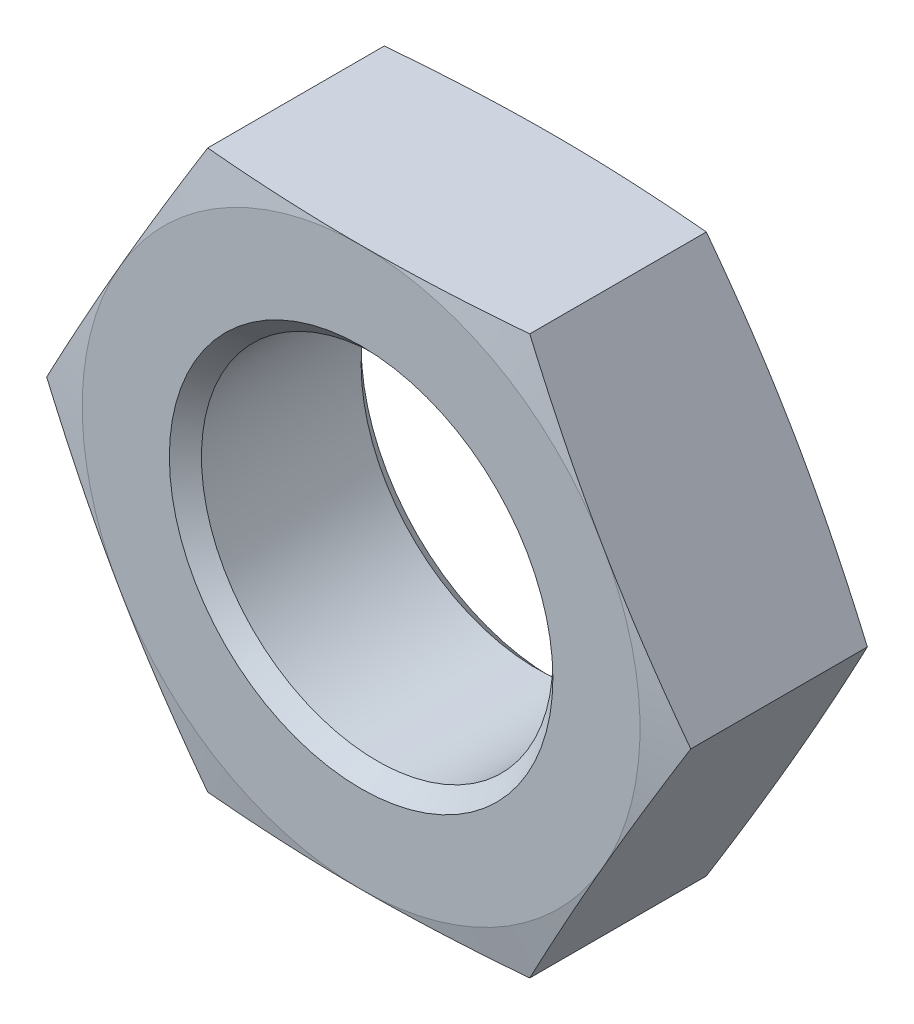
ISO-10303-21;
HEADER;
FILE_DESCRIPTION(('STEP AP214'),'2;1');
FILE_NAME('part.step','',(''),(''),'','','');
FILE_SCHEMA(('AUTOMOTIVE_DESIGN { 1 0 10303 214 1 1 1 1 }'));
ENDSEC;
DATA;
#1=APPLICATION_CONTEXT('core data for automotive mechanical design processes');
#2=APPLICATION_PROTOCOL_DEFINITION('international standard','automotive_design',2000,#1);
#3=PRODUCT_CONTEXT('',#1,'mechanical');
#4=PRODUCT('Part','Part','',(#3));
#5=PRODUCT_RELATED_PRODUCT_CATEGORY('part','',(#4));
#6=PRODUCT_DEFINITION_FORMATION('','',#4);
#7=PRODUCT_DEFINITION_CONTEXT('part definition',#1,'design');
#8=PRODUCT_DEFINITION('design','',#6,#7);
#9=PRODUCT_DEFINITION_SHAPE('','',#8);
#10=(LENGTH_UNIT() NAMED_UNIT(*) SI_UNIT(.MILLI.,.METRE.));
#11=(NAMED_UNIT(*) PLANE_ANGLE_UNIT() SI_UNIT($,.RADIAN.));
#12=(NAMED_UNIT(*) SI_UNIT($,.STERADIAN.) SOLID_ANGLE_UNIT());
#13=UNCERTAINTY_MEASURE_WITH_UNIT(LENGTH_MEASURE(1.E-05),#10,'distance_accuracy_value','');
#14=(GEOMETRIC_REPRESENTATION_CONTEXT(3) GLOBAL_UNCERTAINTY_ASSIGNED_CONTEXT((#13)) GLOBAL_UNIT_ASSIGNED_CONTEXT((#10,
#11,#12)) REPRESENTATION_CONTEXT('',''));
#15=CARTESIAN_POINT('',(0.,0.,0.));
#16=DIRECTION('',(0.,0.,1.));
#17=DIRECTION('',(1.,0.,0.));
#18=AXIS2_PLACEMENT_3D('',#15,#16,#17);
#19=CARTESIAN_POINT('',(0.,13.5,22.));
#20=DIRECTION('',(0.,0.,1.));
#21=DIRECTION('',(1.,0.,0.));
#22=AXIS2_PLACEMENT_3D('',#19,#20,#21);
#23=PLANE('',#22);
#24=CARTESIAN_POINT('',(0.,0.,22.));
#25=DIRECTION('',(0.,0.,-1.));
#26=DIRECTION('',(-1.,0.,0.));
#27=AXIS2_PLACEMENT_3D('',#24,#25,#26);
#28=CIRCLE('',#27,16.);
#29=CARTESIAN_POINT('',(0.,-16.,22.));
#30=VERTEX_POINT('',#29);
#31=CARTESIAN_POINT('',(-13.856406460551,-8.,22.));
#32=VERTEX_POINT('',#31);
#33=EDGE_CURVE('E106',#30,#32,#28,.T.);
#34=ORIENTED_EDGE('',*,*,#33,.F.);
#35=CARTESIAN_POINT('',(0.,0.,22.));
#36=DIRECTION('',(0.,0.,-1.));
#37=DIRECTION('',(-1.,0.,0.));
#38=AXIS2_PLACEMENT_3D('',#35,#36,#37);
#39=CIRCLE('',#38,16.);
#40=CARTESIAN_POINT('',(13.856406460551,-8.,22.));
#41=VERTEX_POINT('',#40);
#42=EDGE_CURVE('E21',#41,#30,#39,.T.);
#43=ORIENTED_EDGE('',*,*,#42,.F.);
#44=CARTESIAN_POINT('',(0.,0.,22.));
#45=DIRECTION('',(0.,0.,-1.));
#46=DIRECTION('',(-1.,0.,0.));
#47=AXIS2_PLACEMENT_3D('',#44,#45,#46);
#48=CIRCLE('',#47,16.);
#49=CARTESIAN_POINT('',(13.856406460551,8.,22.));
#50=VERTEX_POINT('',#49);
#51=EDGE_CURVE('E417',#50,#41,#48,.T.);
#52=ORIENTED_EDGE('',*,*,#51,.F.);
#53=CARTESIAN_POINT('',(0.,0.,22.));
#54=DIRECTION('',(0.,0.,-1.));
#55=DIRECTION('',(-1.,0.,0.));
#56=AXIS2_PLACEMENT_3D('',#53,#54,#55);
#57=CIRCLE('',#56,16.);
#58=CARTESIAN_POINT('',(0.,16.,22.));
#59=VERTEX_POINT('',#58);
#60=EDGE_CURVE('E419',#59,#50,#57,.T.);
#61=ORIENTED_EDGE('',*,*,#60,.F.);
#62=CARTESIAN_POINT('',(0.,0.,22.));
#63=DIRECTION('',(0.,0.,-1.));
#64=DIRECTION('',(-1.,0.,0.));
#65=AXIS2_PLACEMENT_3D('',#62,#63,#64);
#66=CIRCLE('',#65,16.);
#67=CARTESIAN_POINT('',(-13.856406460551,8.,22.));
#68=VERTEX_POINT('',#67);
#69=EDGE_CURVE('E416',#68,#59,#66,.T.);
#70=ORIENTED_EDGE('',*,*,#69,.F.);
#71=CARTESIAN_POINT('',(0.,0.,22.));
#72=DIRECTION('',(0.,0.,-1.));
#73=DIRECTION('',(-1.,0.,0.));
#74=AXIS2_PLACEMENT_3D('',#71,#72,#73);
#75=CIRCLE('',#74,16.);
#76=EDGE_CURVE('E110',#32,#68,#75,.T.);
#77=ORIENTED_EDGE('',*,*,#76,.F.);
#78=EDGE_LOOP('',(#34,#43,#52,#61,#70,#77));
#79=FACE_BOUND('',#78,.T.);
#80=CARTESIAN_POINT('',(0.,0.,22.));
#81=DIRECTION('',(0.,0.,1.));
#82=DIRECTION('',(1.,0.,0.));
#83=AXIS2_PLACEMENT_3D('',#80,#81,#82);
#84=CIRCLE('',#83,11.);
#85=CARTESIAN_POINT('',(11.,0.,22.));
#86=VERTEX_POINT('',#85);
#87=EDGE_CURVE('E165',#86,#86,#84,.T.);
#88=ORIENTED_EDGE('',*,*,#87,.F.);
#89=EDGE_LOOP('',(#88));
#90=FACE_BOUND('',#89,.T.);
#91=ADVANCED_FACE('F17',(#79,#90),#23,.T.);
#92=CARTESIAN_POINT('',(0.,0.,21.5609352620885));
#93=DIRECTION('',(0.,0.,-1.));
#94=DIRECTION('',(-1.,0.,0.));
#95=AXIS2_PLACEMENT_3D('',#92,#93,#94);
#96=CONICAL_SURFACE('',#95,18.4900598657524,1.39626340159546);
#97=ORIENTED_EDGE('',*,*,#42,.T.);
#98=CARTESIAN_POINT('',(0.,-16.,22.));
#99=CARTESIAN_POINT('',(0.38557729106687,-16.,22.0000136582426));
#100=CARTESIAN_POINT('',(0.771153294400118,-16.,21.997542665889));
#101=CARTESIAN_POINT('',(1.54223845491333,-16.,21.9877318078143));
#102=CARTESIAN_POINT('',(1.92774761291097,-16.,21.9803920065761));
#103=CARTESIAN_POINT('',(2.69845544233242,-16.,21.9609487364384));
#104=CARTESIAN_POINT('',(3.08365417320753,-16.,21.948847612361));
#105=CARTESIAN_POINT('',(3.85388000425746,-16.,21.9200732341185));
#106=CARTESIAN_POINT('',(4.2389071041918,-16.,21.9033999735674));
#107=CARTESIAN_POINT('',(5.39357867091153,-16.,21.846868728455));
#108=CARTESIAN_POINT('',(6.16290591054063,-16.,21.8004968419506));
#109=CARTESIAN_POINT('',(7.70089784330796,-16.,21.6927162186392));
#110=CARTESIAN_POINT('',(8.46956201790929,-16.,21.6313000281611));
#111=CARTESIAN_POINT('',(9.23760430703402,-16.,21.5635539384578));
#112=B_SPLINE_CURVE_WITH_KNOTS('',3,(#98,#99,#100,#101,#102,#103,#104,#105,#106,#107,#108,#109,
#110,#111),.UNSPECIFIED.,.F.,.F.,(4,2,2,2,2,2,4),(0.,1.15672186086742,2.31342840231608,
3.46956600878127,4.62570523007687,6.93770612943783,9.2508548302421),.UNSPECIFIED.);
#113=CARTESIAN_POINT('',(9.23760430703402,-16.,21.5635539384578));
#114=VERTEX_POINT('',#113);
#115=EDGE_CURVE('E121',#30,#114,#112,.T.);
#116=ORIENTED_EDGE('',*,*,#115,.T.);
#117=CARTESIAN_POINT('',(9.23760430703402,-16.,21.5635539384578));
#118=CARTESIAN_POINT('',(9.62162545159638,-15.3348558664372,21.6313000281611));
#119=CARTESIAN_POINT('',(10.005957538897,-14.6691731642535,21.6927162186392));
#120=CARTESIAN_POINT('',(10.7749535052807,-13.3372330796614,21.8004968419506));
#121=CARTESIAN_POINT('',(11.1596171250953,-12.6709761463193,21.846868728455));
#122=CARTESIAN_POINT('',(11.7369529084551,-11.6710012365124,21.9033999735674));
#123=CARTESIAN_POINT('',(11.9294664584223,-11.3375579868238,21.9200732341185));
#124=CARTESIAN_POINT('',(12.3145793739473,-10.6705228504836,21.948847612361));
#125=CARTESIAN_POINT('',(12.5071787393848,-10.3369309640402,21.9609487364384));
#126=CARTESIAN_POINT('',(12.8925326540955,-9.66947840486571,21.9803920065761));
#127=CARTESIAN_POINT('',(13.0852872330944,-9.33561768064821,21.9877318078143));
#128=CARTESIAN_POINT('',(13.470829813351,-8.66783834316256,21.997542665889));
#129=CARTESIAN_POINT('',(13.6636178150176,-8.33391972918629,22.0000136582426));
#130=CARTESIAN_POINT('',(13.856406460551,-8.,22.));
#131=B_SPLINE_CURVE_WITH_KNOTS('',3,(#117,#118,#119,#120,#121,#122,#123,#124,#125,#126,#127,
#128,#129,#130),.UNSPECIFIED.,.F.,.F.,(4,2,2,2,2,2,4),(0.,2.31314870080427,4.62514960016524,
5.78128882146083,6.93742642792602,8.09413296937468,9.2508548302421),.UNSPECIFIED.);
#132=EDGE_CURVE('E127',#114,#41,#131,.T.);
#133=ORIENTED_EDGE('',*,*,#132,.T.);
#134=EDGE_LOOP('',(#97,#116,#133));
#135=FACE_BOUND('',#134,.T.);
#136=ADVANCED_FACE('F125',(#135),#96,.T.);
#137=CARTESIAN_POINT('',(0.,0.,21.5609352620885));
#138=DIRECTION('',(0.,0.,-1.));
#139=DIRECTION('',(-1.,0.,0.));
#140=AXIS2_PLACEMENT_3D('',#137,#138,#139);
#141=CONICAL_SURFACE('',#140,18.4900598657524,1.39626340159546);
#142=CARTESIAN_POINT('',(-9.23760430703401,-16.,21.5635539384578));
#143=CARTESIAN_POINT('',(-8.46956201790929,-16.,21.6313000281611));
#144=CARTESIAN_POINT('',(-7.70089784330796,-16.,21.6927162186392));
#145=CARTESIAN_POINT('',(-6.16290591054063,-16.,21.8004968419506));
#146=CARTESIAN_POINT('',(-5.39357867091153,-16.,21.846868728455));
#147=CARTESIAN_POINT('',(-4.2389071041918,-16.,21.9033999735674));
#148=CARTESIAN_POINT('',(-3.85388000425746,-16.,21.9200732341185));
#149=CARTESIAN_POINT('',(-3.08365417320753,-16.,21.948847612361));
#150=CARTESIAN_POINT('',(-2.69845544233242,-16.,21.9609487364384));
#151=CARTESIAN_POINT('',(-1.92774761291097,-16.,21.9803920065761));
#152=CARTESIAN_POINT('',(-1.54223845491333,-16.,21.9877318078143));
#153=CARTESIAN_POINT('',(-0.771153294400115,-16.,21.997542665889));
#154=CARTESIAN_POINT('',(-0.385577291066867,-16.,22.0000136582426));
#155=CARTESIAN_POINT('',(0.,-16.,22.));
#156=B_SPLINE_CURVE_WITH_KNOTS('',3,(#142,#143,#144,#145,#146,#147,#148,#149,#150,#151,#152,
#153,#154,#155),.UNSPECIFIED.,.F.,.F.,(4,2,2,2,2,2,4),(0.,2.31314870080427,4.62514960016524,
5.78128882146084,6.93742642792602,8.09413296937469,9.2508548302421),.UNSPECIFIED.);
#157=CARTESIAN_POINT('',(-9.23760430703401,-16.,21.5635539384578));
#158=VERTEX_POINT('',#157);
#159=EDGE_CURVE('E115',#158,#30,#156,.T.);
#160=ORIENTED_EDGE('',*,*,#159,.T.);
#161=ORIENTED_EDGE('',*,*,#33,.T.);
#162=CARTESIAN_POINT('',(-13.856406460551,-8.,22.));
#163=CARTESIAN_POINT('',(-13.6636178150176,-8.3339197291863,22.0000136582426));
#164=CARTESIAN_POINT('',(-13.470829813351,-8.66783834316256,21.997542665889));
#165=CARTESIAN_POINT('',(-13.0852872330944,-9.33561768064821,21.9877318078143));
#166=CARTESIAN_POINT('',(-12.8925326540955,-9.66947840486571,21.9803920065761));
#167=CARTESIAN_POINT('',(-12.5071787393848,-10.3369309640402,21.9609487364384));
#168=CARTESIAN_POINT('',(-12.3145793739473,-10.6705228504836,21.948847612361));
#169=CARTESIAN_POINT('',(-11.9294664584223,-11.3375579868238,21.9200732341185));
#170=CARTESIAN_POINT('',(-11.7369529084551,-11.6710012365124,21.9033999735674));
#171=CARTESIAN_POINT('',(-11.1596171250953,-12.6709761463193,21.846868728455));
#172=CARTESIAN_POINT('',(-10.7749535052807,-13.3372330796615,21.8004968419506));
#173=CARTESIAN_POINT('',(-10.005957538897,-14.6691731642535,21.6927162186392));
#174=CARTESIAN_POINT('',(-9.62162545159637,-15.3348558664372,21.6313000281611));
#175=CARTESIAN_POINT('',(-9.23760430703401,-16.,21.5635539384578));
#176=B_SPLINE_CURVE_WITH_KNOTS('',3,(#162,#163,#164,#165,#166,#167,#168,#169,#170,#171,#172,
#173,#174,#175),.UNSPECIFIED.,.F.,.F.,(4,2,2,2,2,2,4),(0.,1.15672186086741,2.31342840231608,
3.46956600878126,4.62570523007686,6.93770612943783,9.2508548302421),.UNSPECIFIED.);
#177=EDGE_CURVE('E117',#32,#158,#176,.T.);
#178=ORIENTED_EDGE('',*,*,#177,.T.);
#179=EDGE_LOOP('',(#160,#161,#178));
#180=FACE_BOUND('',#179,.T.);
#181=ADVANCED_FACE('F116',(#180),#141,.T.);
#182=CARTESIAN_POINT('',(0.,0.,21.5609352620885));
#183=DIRECTION('',(0.,0.,-1.));
#184=DIRECTION('',(-1.,0.,0.));
#185=AXIS2_PLACEMENT_3D('',#182,#183,#184);
#186=CONICAL_SURFACE('',#185,18.4900598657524,1.39626340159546);
#187=CARTESIAN_POINT('',(-18.475208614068,0.,21.5635539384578));
#188=CARTESIAN_POINT('',(-18.0911874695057,-0.665144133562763,21.6313000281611));
#189=CARTESIAN_POINT('',(-17.706855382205,-1.33082683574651,21.6927162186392));
#190=CARTESIAN_POINT('',(-16.9378594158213,-2.66276692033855,21.8004968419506));
#191=CARTESIAN_POINT('',(-16.5531957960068,-3.32902385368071,21.846868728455));
#192=CARTESIAN_POINT('',(-15.9758600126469,-4.32899876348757,21.9033999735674));
#193=CARTESIAN_POINT('',(-15.7833464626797,-4.66244201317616,21.9200732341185));
#194=CARTESIAN_POINT('',(-15.3982335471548,-5.32947714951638,21.948847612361));
#195=CARTESIAN_POINT('',(-15.2056341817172,-5.66306903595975,21.9609487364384));
#196=CARTESIAN_POINT('',(-14.8202802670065,-6.33052159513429,21.9803920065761));
#197=CARTESIAN_POINT('',(-14.6275256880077,-6.66438231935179,21.9877318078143));
#198=CARTESIAN_POINT('',(-14.2419831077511,-7.33216165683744,21.997542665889));
#199=CARTESIAN_POINT('',(-14.0491951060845,-7.66608027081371,22.0000136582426));
#200=CARTESIAN_POINT('',(-13.856406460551,-8.,22.));
#201=B_SPLINE_CURVE_WITH_KNOTS('',3,(#187,#188,#189,#190,#191,#192,#193,#194,#195,#196,#197,
#198,#199,#200),.UNSPECIFIED.,.F.,.F.,(4,2,2,2,2,2,4),(0.,2.31314870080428,4.62514960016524,
5.78128882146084,6.93742642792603,8.09413296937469,9.2508548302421),.UNSPECIFIED.);
#202=CARTESIAN_POINT('',(-18.475208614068,0.,21.5635539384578));
#203=VERTEX_POINT('',#202);
#204=EDGE_CURVE('E134',#203,#32,#201,.T.);
#205=ORIENTED_EDGE('',*,*,#204,.T.);
#206=ORIENTED_EDGE('',*,*,#76,.T.);
#207=CARTESIAN_POINT('',(-13.856406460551,8.,22.));
#208=CARTESIAN_POINT('',(-14.0491951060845,7.66608027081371,22.0000136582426));
#209=CARTESIAN_POINT('',(-14.2419831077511,7.33216165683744,21.997542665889));
#210=CARTESIAN_POINT('',(-14.6275256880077,6.66438231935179,21.9877318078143));
#211=CARTESIAN_POINT('',(-14.8202802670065,6.33052159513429,21.9803920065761));
#212=CARTESIAN_POINT('',(-15.2056341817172,5.66306903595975,21.9609487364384));
#213=CARTESIAN_POINT('',(-15.3982335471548,5.32947714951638,21.948847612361));
#214=CARTESIAN_POINT('',(-15.7833464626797,4.66244201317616,21.9200732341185));
#215=CARTESIAN_POINT('',(-15.9758600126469,4.32899876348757,21.9033999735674));
#216=CARTESIAN_POINT('',(-16.5531957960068,3.32902385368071,21.846868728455));
#217=CARTESIAN_POINT('',(-16.9378594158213,2.66276692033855,21.8004968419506));
#218=CARTESIAN_POINT('',(-17.706855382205,1.33082683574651,21.6927162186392));
#219=CARTESIAN_POINT('',(-18.0911874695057,0.665144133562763,21.6313000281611));
#220=CARTESIAN_POINT('',(-18.475208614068,0.,21.5635539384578));
#221=B_SPLINE_CURVE_WITH_KNOTS('',3,(#207,#208,#209,#210,#211,#212,#213,#214,#215,#216,#217,
#218,#219,#220),.UNSPECIFIED.,.F.,.F.,(4,2,2,2,2,2,4),(0.,1.15672186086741,2.31342840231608,
3.46956600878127,4.62570523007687,6.93770612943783,9.2508548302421),.UNSPECIFIED.);
#222=EDGE_CURVE('E375',#68,#203,#221,.T.);
#223=ORIENTED_EDGE('',*,*,#222,.T.);
#224=EDGE_LOOP('',(#205,#206,#223));
#225=FACE_BOUND('',#224,.T.);
#226=ADVANCED_FACE('F365',(#225),#186,.T.);
#227=CARTESIAN_POINT('',(0.,0.,21.5609352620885));
#228=DIRECTION('',(0.,0.,-1.));
#229=DIRECTION('',(-1.,0.,0.));
#230=AXIS2_PLACEMENT_3D('',#227,#228,#229);
#231=CONICAL_SURFACE('',#230,18.4900598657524,1.39626340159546);
#232=ORIENTED_EDGE('',*,*,#69,.T.);
#233=CARTESIAN_POINT('',(0.,16.,22.));
#234=CARTESIAN_POINT('',(-0.385577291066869,16.,22.0000136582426));
#235=CARTESIAN_POINT('',(-0.771153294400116,16.,21.997542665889));
#236=CARTESIAN_POINT('',(-1.54223845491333,16.,21.9877318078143));
#237=CARTESIAN_POINT('',(-1.92774761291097,16.,21.9803920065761));
#238=CARTESIAN_POINT('',(-2.69845544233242,16.,21.9609487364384));
#239=CARTESIAN_POINT('',(-3.08365417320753,16.,21.948847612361));
#240=CARTESIAN_POINT('',(-3.85388000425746,16.,21.9200732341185));
#241=CARTESIAN_POINT('',(-4.2389071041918,16.,21.9033999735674));
#242=CARTESIAN_POINT('',(-5.39357867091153,16.,21.846868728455));
#243=CARTESIAN_POINT('',(-6.16290591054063,16.,21.8004968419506));
#244=CARTESIAN_POINT('',(-7.70089784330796,16.,21.6927162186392));
#245=CARTESIAN_POINT('',(-8.46956201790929,16.,21.6313000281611));
#246=CARTESIAN_POINT('',(-9.23760430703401,16.,21.5635539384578));
#247=B_SPLINE_CURVE_WITH_KNOTS('',3,(#233,#234,#235,#236,#237,#238,#239,#240,#241,#242,#243,
#244,#245,#246),.UNSPECIFIED.,.F.,.F.,(4,2,2,2,2,2,4),(0.,1.15672186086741,2.31342840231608,
3.46956600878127,4.62570523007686,6.93770612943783,9.2508548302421),.UNSPECIFIED.);
#248=CARTESIAN_POINT('',(-9.23760430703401,16.,21.5635539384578));
#249=VERTEX_POINT('',#248);
#250=EDGE_CURVE('E337',#59,#249,#247,.T.);
#251=ORIENTED_EDGE('',*,*,#250,.T.);
#252=CARTESIAN_POINT('',(-9.23760430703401,16.,21.5635539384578));
#253=CARTESIAN_POINT('',(-9.62162545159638,15.3348558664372,21.6313000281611));
#254=CARTESIAN_POINT('',(-10.005957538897,14.6691731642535,21.6927162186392));
#255=CARTESIAN_POINT('',(-10.7749535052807,13.3372330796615,21.8004968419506));
#256=CARTESIAN_POINT('',(-11.1596171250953,12.6709761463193,21.846868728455));
#257=CARTESIAN_POINT('',(-11.7369529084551,11.6710012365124,21.9033999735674));
#258=CARTESIAN_POINT('',(-11.9294664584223,11.3375579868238,21.9200732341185));
#259=CARTESIAN_POINT('',(-12.3145793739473,10.6705228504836,21.948847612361));
#260=CARTESIAN_POINT('',(-12.5071787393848,10.3369309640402,21.9609487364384));
#261=CARTESIAN_POINT('',(-12.8925326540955,9.66947840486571,21.9803920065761));
#262=CARTESIAN_POINT('',(-13.0852872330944,9.33561768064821,21.9877318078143));
#263=CARTESIAN_POINT('',(-13.470829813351,8.66783834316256,21.997542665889));
#264=CARTESIAN_POINT('',(-13.6636178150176,8.3339197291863,22.0000136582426));
#265=CARTESIAN_POINT('',(-13.856406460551,8.,22.));
#266=B_SPLINE_CURVE_WITH_KNOTS('',3,(#252,#253,#254,#255,#256,#257,#258,#259,#260,#261,#262,
#263,#264,#265),.UNSPECIFIED.,.F.,.F.,(4,2,2,2,2,2,4),(0.,2.31314870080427,4.62514960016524,
5.78128882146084,6.93742642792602,8.09413296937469,9.2508548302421),.UNSPECIFIED.);
#267=EDGE_CURVE('E369',#249,#68,#266,.T.);
#268=ORIENTED_EDGE('',*,*,#267,.T.);
#269=EDGE_LOOP('',(#232,#251,#268));
#270=FACE_BOUND('',#269,.T.);
#271=ADVANCED_FACE('F361',(#270),#231,.T.);
#272=CARTESIAN_POINT('',(0.,0.,21.5609352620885));
#273=DIRECTION('',(0.,0.,-1.));
#274=DIRECTION('',(-1.,0.,0.));
#275=AXIS2_PLACEMENT_3D('',#272,#273,#274);
#276=CONICAL_SURFACE('',#275,18.4900598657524,1.39626340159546);
#277=ORIENTED_EDGE('',*,*,#51,.T.);
#278=CARTESIAN_POINT('',(13.856406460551,-8.,22.));
#279=CARTESIAN_POINT('',(14.0491951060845,-7.6660802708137,22.0000136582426));
#280=CARTESIAN_POINT('',(14.2419831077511,-7.33216165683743,21.997542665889));
#281=CARTESIAN_POINT('',(14.6275256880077,-6.66438231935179,21.9877318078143));
#282=CARTESIAN_POINT('',(14.8202802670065,-6.33052159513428,21.9803920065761));
#283=CARTESIAN_POINT('',(15.2056341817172,-5.66306903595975,21.9609487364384));
#284=CARTESIAN_POINT('',(15.3982335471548,-5.32947714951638,21.948847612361));
#285=CARTESIAN_POINT('',(15.7833464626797,-4.66244201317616,21.9200732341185));
#286=CARTESIAN_POINT('',(15.9758600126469,-4.32899876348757,21.9033999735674));
#287=CARTESIAN_POINT('',(16.5531957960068,-3.32902385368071,21.846868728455));
#288=CARTESIAN_POINT('',(16.9378594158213,-2.66276692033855,21.8004968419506));
#289=CARTESIAN_POINT('',(17.706855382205,-1.33082683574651,21.6927162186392));
#290=CARTESIAN_POINT('',(18.0911874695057,-0.665144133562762,21.6313000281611));
#291=CARTESIAN_POINT('',(18.475208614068,0.,21.5635539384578));
#292=B_SPLINE_CURVE_WITH_KNOTS('',3,(#278,#279,#280,#281,#282,#283,#284,#285,#286,#287,#288,
#289,#290,#291),.UNSPECIFIED.,.F.,.F.,(4,2,2,2,2,2,4),(0.,1.15672186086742,2.31342840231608,
3.46956600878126,4.62570523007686,6.93770612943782,9.2508548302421),.UNSPECIFIED.);
#293=CARTESIAN_POINT('',(18.475208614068,0.,21.5635539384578));
#294=VERTEX_POINT('',#293);
#295=EDGE_CURVE('E122',#41,#294,#292,.T.);
#296=ORIENTED_EDGE('',*,*,#295,.T.);
#297=CARTESIAN_POINT('',(18.475208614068,0.,21.5635539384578));
#298=CARTESIAN_POINT('',(18.0911874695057,0.665144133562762,21.6313000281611));
#299=CARTESIAN_POINT('',(17.706855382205,1.33082683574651,21.6927162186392));
#300=CARTESIAN_POINT('',(16.9378594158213,2.66276692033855,21.8004968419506));
#301=CARTESIAN_POINT('',(16.5531957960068,3.32902385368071,21.846868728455));
#302=CARTESIAN_POINT('',(15.9758600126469,4.32899876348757,21.9033999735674));
#303=CARTESIAN_POINT('',(15.7833464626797,4.66244201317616,21.9200732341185));
#304=CARTESIAN_POINT('',(15.3982335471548,5.32947714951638,21.948847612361));
#305=CARTESIAN_POINT('',(15.2056341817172,5.66306903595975,21.9609487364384));
#306=CARTESIAN_POINT('',(14.8202802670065,6.33052159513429,21.9803920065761));
#307=CARTESIAN_POINT('',(14.6275256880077,6.66438231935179,21.9877318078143));
#308=CARTESIAN_POINT('',(14.2419831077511,7.33216165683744,21.997542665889));
#309=CARTESIAN_POINT('',(14.0491951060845,7.6660802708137,22.0000136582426));
#310=CARTESIAN_POINT('',(13.856406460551,8.,22.));
#311=B_SPLINE_CURVE_WITH_KNOTS('',3,(#297,#298,#299,#300,#301,#302,#303,#304,#305,#306,#307,
#308,#309,#310),.UNSPECIFIED.,.F.,.F.,(4,2,2,2,2,2,4),(0.,2.31314870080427,4.62514960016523,
5.78128882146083,6.93742642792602,8.09413296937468,9.2508548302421),.UNSPECIFIED.);
#312=EDGE_CURVE('E339',#294,#50,#311,.T.);
#313=ORIENTED_EDGE('',*,*,#312,.T.);
#314=EDGE_LOOP('',(#277,#296,#313));
#315=FACE_BOUND('',#314,.T.);
#316=ADVANCED_FACE('F364',(#315),#276,.T.);
#317=CARTESIAN_POINT('',(0.,0.,21.5609352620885));
#318=DIRECTION('',(0.,0.,-1.));
#319=DIRECTION('',(-1.,0.,0.));
#320=AXIS2_PLACEMENT_3D('',#317,#318,#319);
#321=CONICAL_SURFACE('',#320,18.4900598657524,1.39626340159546);
#322=ORIENTED_EDGE('',*,*,#60,.T.);
#323=CARTESIAN_POINT('',(13.856406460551,8.,22.));
#324=CARTESIAN_POINT('',(13.6636178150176,8.3339197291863,22.0000136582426));
#325=CARTESIAN_POINT('',(13.470829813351,8.66783834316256,21.997542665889));
#326=CARTESIAN_POINT('',(13.0852872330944,9.33561768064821,21.9877318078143));
#327=CARTESIAN_POINT('',(12.8925326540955,9.66947840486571,21.9803920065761));
#328=CARTESIAN_POINT('',(12.5071787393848,10.3369309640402,21.9609487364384));
#329=CARTESIAN_POINT('',(12.3145793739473,10.6705228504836,21.948847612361));
#330=CARTESIAN_POINT('',(11.9294664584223,11.3375579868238,21.9200732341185));
#331=CARTESIAN_POINT('',(11.7369529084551,11.6710012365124,21.9033999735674));
#332=CARTESIAN_POINT('',(11.1596171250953,12.6709761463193,21.846868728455));
#333=CARTESIAN_POINT('',(10.7749535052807,13.3372330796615,21.8004968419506));
#334=CARTESIAN_POINT('',(10.005957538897,14.6691731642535,21.6927162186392));
#335=CARTESIAN_POINT('',(9.62162545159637,15.3348558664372,21.6313000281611));
#336=CARTESIAN_POINT('',(9.23760430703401,16.,21.5635539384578));
#337=B_SPLINE_CURVE_WITH_KNOTS('',3,(#323,#324,#325,#326,#327,#328,#329,#330,#331,#332,#333,
#334,#335,#336),.UNSPECIFIED.,.F.,.F.,(4,2,2,2,2,2,4),(0.,1.15672186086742,2.31342840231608,
3.46956600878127,4.62570523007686,6.93770612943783,9.2508548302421),.UNSPECIFIED.);
#338=CARTESIAN_POINT('',(9.23760430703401,16.,21.5635539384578));
#339=VERTEX_POINT('',#338);
#340=EDGE_CURVE('E307',#50,#339,#337,.T.);
#341=ORIENTED_EDGE('',*,*,#340,.T.);
#342=CARTESIAN_POINT('',(9.23760430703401,16.,21.5635539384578));
#343=CARTESIAN_POINT('',(8.46956201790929,16.,21.6313000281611));
#344=CARTESIAN_POINT('',(7.70089784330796,16.,21.6927162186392));
#345=CARTESIAN_POINT('',(6.16290591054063,16.,21.8004968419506));
#346=CARTESIAN_POINT('',(5.39357867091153,16.,21.846868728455));
#347=CARTESIAN_POINT('',(4.2389071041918,16.,21.9033999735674));
#348=CARTESIAN_POINT('',(3.85388000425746,16.,21.9200732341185));
#349=CARTESIAN_POINT('',(3.08365417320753,16.,21.948847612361));
#350=CARTESIAN_POINT('',(2.69845544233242,16.,21.9609487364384));
#351=CARTESIAN_POINT('',(1.92774761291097,16.,21.9803920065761));
#352=CARTESIAN_POINT('',(1.54223845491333,16.,21.9877318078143));
#353=CARTESIAN_POINT('',(0.771153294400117,16.,21.997542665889));
#354=CARTESIAN_POINT('',(0.385577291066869,16.,22.0000136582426));
#355=CARTESIAN_POINT('',(0.,16.,22.));
#356=B_SPLINE_CURVE_WITH_KNOTS('',3,(#342,#343,#344,#345,#346,#347,#348,#349,#350,#351,#352,
#353,#354,#355),.UNSPECIFIED.,.F.,.F.,(4,2,2,2,2,2,4),(0.,2.31314870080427,4.62514960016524,
5.78128882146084,6.93742642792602,8.09413296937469,9.2508548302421),.UNSPECIFIED.);
#357=EDGE_CURVE('E334',#339,#59,#356,.T.);
#358=ORIENTED_EDGE('',*,*,#357,.T.);
#359=EDGE_LOOP('',(#322,#341,#358));
#360=FACE_BOUND('',#359,.T.);
#361=ADVANCED_FACE('F457',(#360),#321,.T.);
#362=CARTESIAN_POINT('',(0.,0.,21.08));
#363=DIRECTION('',(0.,0.,1.));
#364=DIRECTION('',(1.,0.,0.));
#365=AXIS2_PLACEMENT_3D('',#362,#363,#364);
#366=CONICAL_SURFACE('',#365,10.08,0.785398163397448);
#367=CARTESIAN_POINT('',(0.,0.,21.08));
#368=DIRECTION('',(0.,0.,-1.));
#369=DIRECTION('',(0.,1.,0.));
#370=AXIS2_PLACEMENT_3D('',#367,#368,#369);
#371=CIRCLE('',#370,10.08);
#372=CARTESIAN_POINT('',(0.,10.08,21.08));
#373=VERTEX_POINT('',#372);
#374=EDGE_CURVE('E305',#373,#373,#371,.F.);
#375=ORIENTED_EDGE('',*,*,#374,.F.);
#376=EDGE_LOOP('',(#375));
#377=FACE_BOUND('',#376,.T.);
#378=ORIENTED_EDGE('',*,*,#87,.T.);
#379=EDGE_LOOP('',(#378));
#380=FACE_BOUND('',#379,.T.);
#381=ADVANCED_FACE('F175',(#377,#380),#366,.F.);
#382=CARTESIAN_POINT('',(27.712812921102,16.,33.));
#383=DIRECTION('',(-0.866025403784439,0.5,0.));
#384=DIRECTION('',(-0.5,-0.866025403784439,0.));
#385=AXIS2_PLACEMENT_3D('',#382,#383,#384);
#386=PLANE('',#385);
#387=ORIENTED_EDGE('',*,*,#295,.F.);
#388=ORIENTED_EDGE('',*,*,#132,.F.);
#389=DIRECTION('',(0.,0.,1.));
#390=VECTOR('',#389,1.);
#391=CARTESIAN_POINT('',(9.23760430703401,-16.,33.));
#392=LINE('',#391,#390);
#393=CARTESIAN_POINT('',(9.23760425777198,-16.,11.4364460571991));
#394=VERTEX_POINT('',#393);
#395=EDGE_CURVE('E132',#114,#394,#392,.F.);
#396=ORIENTED_EDGE('',*,*,#395,.T.);
#397=CARTESIAN_POINT('',(13.856406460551,-8.,11.));
#398=CARTESIAN_POINT('',(13.6636178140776,-8.33391973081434,10.9999863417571));
#399=CARTESIAN_POINT('',(13.4708298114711,-8.66783834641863,11.0024573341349));
#400=CARTESIAN_POINT('',(13.0852872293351,-9.33561768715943,11.0122681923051));
#401=CARTESIAN_POINT('',(12.8925326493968,-9.66947841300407,11.0196079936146));
#402=CARTESIAN_POINT('',(12.5071787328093,-10.3369309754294,11.0390512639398));
#403=CARTESIAN_POINT('',(12.3145793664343,-10.6705228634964,11.0511523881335));
#404=CARTESIAN_POINT('',(11.9294664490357,-11.3375580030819,11.0799267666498));
#405=CARTESIAN_POINT('',(11.7369528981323,-11.6710012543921,11.0966000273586));
#406=CARTESIAN_POINT('',(11.1596171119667,-12.6709761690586,11.1531312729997));
#407=CARTESIAN_POINT('',(10.7749534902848,-13.3372331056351,11.1995031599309));
#408=CARTESIAN_POINT('',(10.00595752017,-14.6691731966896,11.307283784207));
#409=CARTESIAN_POINT('',(9.62162543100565,-15.3348559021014,11.3686999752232));
#410=CARTESIAN_POINT('',(9.23760428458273,-16.0000000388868,11.436446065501));
#411=B_SPLINE_CURVE_WITH_KNOTS('',3,(#397,#398,#399,#400,#401,#402,#403,#404,#405,#406,#407,
#408,#409,#410),.UNSPECIFIED.,.F.,.F.,(4,2,2,2,2,2,4),(0.,1.15672186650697,2.3134284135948,
3.46956602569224,4.62570525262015,6.93770616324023,9.25085487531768),.UNSPECIFIED.);
#412=CARTESIAN_POINT('',(13.856406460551,-8.00000000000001,11.));
#413=VERTEX_POINT('',#412);
#414=EDGE_CURVE('E181',#413,#394,#411,.T.);
#415=ORIENTED_EDGE('',*,*,#414,.F.);
#416=CARTESIAN_POINT('',(18.4752085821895,-1.25533051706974E-08,11.4364460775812));
#417=CARTESIAN_POINT('',(18.0911874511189,-0.665144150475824,11.3686999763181));
#418=CARTESIAN_POINT('',(17.7068553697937,-1.33082685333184,11.307283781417));
#419=CARTESIAN_POINT('',(16.937859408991,-2.66276693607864,11.1995031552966));
#420=CARTESIAN_POINT('',(16.5531957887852,-3.32902386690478,11.1531312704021));
#421=CARTESIAN_POINT('',(15.9758600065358,-4.32899877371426,11.0966000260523));
#422=CARTESIAN_POINT('',(15.7833464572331,-4.66244202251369,11.0799267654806));
#423=CARTESIAN_POINT('',(15.3982335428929,-5.32947715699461,11.0511523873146));
#424=CARTESIAN_POINT('',(15.2056341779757,-5.66306904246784,11.0390512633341));
#425=CARTESIAN_POINT('',(14.8202802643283,-6.33052159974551,11.0196079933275));
#426=CARTESIAN_POINT('',(14.6275256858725,-6.6643823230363,11.012268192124));
#427=CARTESIAN_POINT('',(14.2419831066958,-7.33216165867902,11.0024573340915));
#428=CARTESIAN_POINT('',(14.0491951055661,-7.66608027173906,10.9999863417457));
#429=CARTESIAN_POINT('',(13.856406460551,-8.,11.));
#430=B_SPLINE_CURVE_WITH_KNOTS('',3,(#416,#417,#418,#419,#420,#421,#422,#423,#424,#425,#426,
#427,#428,#429),.UNSPECIFIED.,.F.,.F.,(4,2,2,2,2,2,4),(0.,2.31314869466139,4.62514958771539,
5.78128880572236,6.93742640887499,8.09413294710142,9.25085480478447),.UNSPECIFIED.);
#431=CARTESIAN_POINT('',(18.4752086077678,-1.09122752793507E-08,11.4364460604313));
#432=VERTEX_POINT('',#431);
#433=EDGE_CURVE('E190',#432,#413,#430,.T.);
#434=ORIENTED_EDGE('',*,*,#433,.F.);
#435=DIRECTION('',(0.,0.,1.));
#436=VECTOR('',#435,1.);
#437=CARTESIAN_POINT('',(18.475208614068,0.,0.));
#438=LINE('',#437,#436);
#439=EDGE_CURVE('E336',#432,#294,#438,.T.);
#440=ORIENTED_EDGE('',*,*,#439,.T.);
#441=EDGE_LOOP('',(#387,#388,#396,#415,#434,#440));
#442=FACE_BOUND('',#441,.T.);
#443=ADVANCED_FACE('F171',(#442),#386,.F.);
#444=CARTESIAN_POINT('',(9.23760430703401,-16.,33.));
#445=DIRECTION('',(0.,1.,0.));
#446=DIRECTION('',(0.,0.,1.));
#447=AXIS2_PLACEMENT_3D('',#444,#445,#446);
#448=PLANE('',#447);
#449=ORIENTED_EDGE('',*,*,#395,.F.);
#450=ORIENTED_EDGE('',*,*,#115,.F.);
#451=ORIENTED_EDGE('',*,*,#159,.F.);
#452=DIRECTION('',(0.,0.,1.));
#453=VECTOR('',#452,1.);
#454=CARTESIAN_POINT('',(-9.23760430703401,-16.,33.));
#455=LINE('',#454,#453);
#456=CARTESIAN_POINT('',(-9.2376042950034,-16.0000000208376,11.4364460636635));
#457=VERTEX_POINT('',#456);
#458=EDGE_CURVE('E409',#158,#457,#455,.F.);
#459=ORIENTED_EDGE('',*,*,#458,.T.);
#460=CARTESIAN_POINT('',(0.,-16.,11.));
#461=CARTESIAN_POINT('',(-0.385577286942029,-16.,10.999986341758));
#462=CARTESIAN_POINT('',(-0.771153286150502,-16.,11.0024573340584));
#463=CARTESIAN_POINT('',(-1.54223843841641,-16.,11.0122681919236));
#464=CARTESIAN_POINT('',(-1.92774759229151,-16.,11.0196079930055));
#465=CARTESIAN_POINT('',(-2.69845541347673,-16.,11.0390512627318));
#466=CARTESIAN_POINT('',(-3.08365414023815,-16.,11.0511523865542));
#467=CARTESIAN_POINT('',(-3.85387996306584,-16.,11.0799267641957));
#468=CARTESIAN_POINT('',(-4.23890705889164,-16.,11.0966000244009));
#469=CARTESIAN_POINT('',(-5.39357861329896,-16.,11.1531312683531));
#470=CARTESIAN_POINT('',(-6.16290584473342,-16.,11.199503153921));
#471=CARTESIAN_POINT('',(-7.70089776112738,-16.,11.3072837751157));
#472=CARTESIAN_POINT('',(-8.46956192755,-16.,11.3686999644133));
#473=CARTESIAN_POINT('',(-9.23760420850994,-16.,11.436446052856));
#474=B_SPLINE_CURVE_WITH_KNOTS('',3,(#460,#461,#462,#463,#464,#465,#466,#467,#468,#469,#470,
#471,#472,#473),.UNSPECIFIED.,.F.,.F.,(4,2,2,2,2,2,4),(0.,1.15672184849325,2.31342837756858,
3.46956597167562,4.62570518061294,6.93770605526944,9.25085473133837),.UNSPECIFIED.);
#475=CARTESIAN_POINT('',(0.,-16.,11.));
#476=VERTEX_POINT('',#475);
#477=EDGE_CURVE('E235',#476,#457,#474,.T.);
#478=ORIENTED_EDGE('',*,*,#477,.F.);
#479=CARTESIAN_POINT('',(9.23760420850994,-16.,11.436446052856));
#480=CARTESIAN_POINT('',(8.46956192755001,-16.,11.3686999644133));
#481=CARTESIAN_POINT('',(7.70089776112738,-16.,11.3072837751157));
#482=CARTESIAN_POINT('',(6.16290584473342,-16.,11.199503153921));
#483=CARTESIAN_POINT('',(5.39357861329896,-16.,11.1531312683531));
#484=CARTESIAN_POINT('',(4.23890705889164,-16.,11.0966000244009));
#485=CARTESIAN_POINT('',(3.85387996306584,-16.,11.0799267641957));
#486=CARTESIAN_POINT('',(3.08365414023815,-16.,11.0511523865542));
#487=CARTESIAN_POINT('',(2.69845541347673,-16.,11.0390512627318));
#488=CARTESIAN_POINT('',(1.9277475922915,-16.,11.0196079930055));
#489=CARTESIAN_POINT('',(1.5422384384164,-16.,11.0122681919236));
#490=CARTESIAN_POINT('',(0.771153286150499,-16.,11.0024573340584));
#491=CARTESIAN_POINT('',(0.385577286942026,-16.,10.999986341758));
#492=CARTESIAN_POINT('',(0.,-16.,11.));
#493=B_SPLINE_CURVE_WITH_KNOTS('',3,(#479,#480,#481,#482,#483,#484,#485,#486,#487,#488,#489,
#490,#491,#492),.UNSPECIFIED.,.F.,.F.,(4,2,2,2,2,2,4),(0.,2.31314867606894,4.62514955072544,
5.78128875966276,6.9374263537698,8.09413288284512,9.25085473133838),.UNSPECIFIED.);
#494=EDGE_CURVE('E197',#394,#476,#493,.T.);
#495=ORIENTED_EDGE('',*,*,#494,.F.);
#496=EDGE_LOOP('',(#449,#450,#451,#459,#478,#495));
#497=FACE_BOUND('',#496,.T.);
#498=ADVANCED_FACE('F130',(#497),#448,.F.);
#499=CARTESIAN_POINT('',(-9.23760430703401,-16.,33.));
#500=DIRECTION('',(0.866025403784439,0.5,0.));
#501=DIRECTION('',(-0.5,0.866025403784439,0.));
#502=AXIS2_PLACEMENT_3D('',#499,#500,#501);
#503=PLANE('',#502);
#504=CARTESIAN_POINT('',(-13.856406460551,-8.,11.));
#505=CARTESIAN_POINT('',(-14.0491951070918,-7.66608026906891,10.9999863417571));
#506=CARTESIAN_POINT('',(-14.2419831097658,-7.33216165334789,11.0024573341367));
#507=CARTESIAN_POINT('',(-14.6275256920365,-6.66438231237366,11.0122681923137));
#508=CARTESIAN_POINT('',(-14.8202802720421,-6.33052158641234,11.0196079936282));
#509=CARTESIAN_POINT('',(-15.2056341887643,-5.66306902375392,11.0390512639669));
#510=CARTESIAN_POINT('',(-15.3982335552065,-5.32947713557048,11.0511523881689));
#511=CARTESIAN_POINT('',(-15.7833464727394,-4.66244199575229,11.0799267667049));
#512=CARTESIAN_POINT('',(-15.97586002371,-4.3289987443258,11.096600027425));
#513=CARTESIAN_POINT('',(-16.5531958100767,-3.32902382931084,11.1531312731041));
#514=CARTESIAN_POINT('',(-16.9378594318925,-2.66276689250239,11.1995031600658));
#515=CARTESIAN_POINT('',(-17.7068554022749,-1.33082680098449,11.3072837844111));
#516=CARTESIAN_POINT('',(-18.0911874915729,-0.665144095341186,11.3686999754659));
#517=CARTESIAN_POINT('',(-18.4752086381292,4.16752483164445E-08,11.4364460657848));
#518=B_SPLINE_CURVE_WITH_KNOTS('',3,(#504,#505,#506,#507,#508,#509,#510,#511,#512,#513,#514,
#515,#516,#517),.UNSPECIFIED.,.F.,.F.,(4,2,2,2,2,2,4),(0.,1.15672186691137,2.31342841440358,
3.4695660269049,4.62570525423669,6.93770616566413,9.25085487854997),.UNSPECIFIED.);
#519=CARTESIAN_POINT('',(-13.856406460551,-8.,11.));
#520=VERTEX_POINT('',#519);
#521=CARTESIAN_POINT('',(-18.475208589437,4.26621713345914E-08,11.4364460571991));
#522=VERTEX_POINT('',#521);
#523=EDGE_CURVE('E315',#520,#522,#518,.T.);
#524=ORIENTED_EDGE('',*,*,#523,.F.);
#525=CARTESIAN_POINT('',(-9.23760424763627,-16.0000000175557,11.4364461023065));
#526=CARTESIAN_POINT('',(-9.62162541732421,-15.3348558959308,11.3686999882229));
#527=CARTESIAN_POINT('',(-10.0059575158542,-14.6691731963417,11.3072837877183));
#528=CARTESIAN_POINT('',(-10.7749534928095,-13.3372331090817,11.1995031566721));
#529=CARTESIAN_POINT('',(-11.1596171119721,-12.670976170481,11.153131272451));
#530=CARTESIAN_POINT('',(-11.7369528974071,-11.6710012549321,11.0966000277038));
#531=CARTESIAN_POINT('',(-11.9294664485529,-11.3375580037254,11.0799267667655));
#532=CARTESIAN_POINT('',(-12.3145793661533,-10.6705228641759,11.0511523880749));
#533=CARTESIAN_POINT('',(-12.5071787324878,-10.3369309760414,11.0390512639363));
#534=CARTESIAN_POINT('',(-12.8925326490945,-9.66947841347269,11.0196079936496));
#535=CARTESIAN_POINT('',(-13.0852872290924,-9.33561768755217,11.0122681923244));
#536=CARTESIAN_POINT('',(-13.4708298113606,-8.66783834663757,11.0024573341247));
#537=CARTESIAN_POINT('',(-13.6636178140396,-8.33391973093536,10.9999863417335));
#538=CARTESIAN_POINT('',(-13.856406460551,-8.,11.));
#539=B_SPLINE_CURVE_WITH_KNOTS('',3,(#525,#526,#527,#528,#529,#530,#531,#532,#533,#534,#535,
#536,#537,#538),.UNSPECIFIED.,.F.,.F.,(4,2,2,2,2,2,4),(0.,2.31314871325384,4.62514962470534,
5.78128885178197,6.93742646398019,8.09413301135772,9.25085487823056),.UNSPECIFIED.);
#540=EDGE_CURVE('E230',#457,#520,#539,.T.);
#541=ORIENTED_EDGE('',*,*,#540,.F.);
#542=ORIENTED_EDGE('',*,*,#458,.F.);
#543=ORIENTED_EDGE('',*,*,#177,.F.);
#544=ORIENTED_EDGE('',*,*,#204,.F.);
#545=DIRECTION('',(0.,0.,1.));
#546=VECTOR('',#545,1.);
#547=CARTESIAN_POINT('',(-18.475208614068,0.,0.));
#548=LINE('',#547,#546);
#549=EDGE_CURVE('E374',#203,#522,#548,.F.);
#550=ORIENTED_EDGE('',*,*,#549,.T.);
#551=EDGE_LOOP('',(#524,#541,#542,#543,#544,#550));
#552=FACE_BOUND('',#551,.T.);
#553=ADVANCED_FACE('F382',(#552),#503,.F.);
#554=CARTESIAN_POINT('',(-9.23760430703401,16.,0.));
#555=DIRECTION('',(0.866025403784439,-0.5,0.));
#556=DIRECTION('',(0.5,0.866025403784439,0.));
#557=AXIS2_PLACEMENT_3D('',#554,#555,#556);
#558=PLANE('',#557);
#559=DIRECTION('',(0.,0.,-1.));
#560=VECTOR('',#559,1.);
#561=CARTESIAN_POINT('',(-9.23760430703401,16.,0.));
#562=LINE('',#561,#560);
#563=CARTESIAN_POINT('',(-9.23760433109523,16.,11.4364460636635));
#564=VERTEX_POINT('',#563);
#565=EDGE_CURVE('E345',#249,#564,#562,.T.);
#566=ORIENTED_EDGE('',*,*,#565,.T.);
#567=CARTESIAN_POINT('',(-13.856406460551,8.,11.));
#568=CARTESIAN_POINT('',(-13.66361781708,8.33391972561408,10.999986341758));
#569=CARTESIAN_POINT('',(-13.4708298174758,8.66783833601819,11.0024573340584));
#570=CARTESIAN_POINT('',(-13.0852872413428,9.33561766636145,11.0122681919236));
#571=CARTESIAN_POINT('',(-12.8925326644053,9.66947838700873,11.0196079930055));
#572=CARTESIAN_POINT('',(-12.5071787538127,10.3369309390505,11.0390512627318));
#573=CARTESIAN_POINT('',(-12.3145793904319,10.6705228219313,11.0511523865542));
#574=CARTESIAN_POINT('',(-11.9294664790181,11.3375579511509,11.0799267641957));
#575=CARTESIAN_POINT('',(-11.7369529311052,11.6710011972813,11.0966000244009));
#576=CARTESIAN_POINT('',(-11.1596171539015,12.6709760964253,11.1531312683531));
#577=CARTESIAN_POINT('',(-10.7749535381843,13.3372330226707,11.199503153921));
#578=CARTESIAN_POINT('',(-10.0059575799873,14.669173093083,11.3072837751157));
#579=CARTESIAN_POINT('',(-9.62162549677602,15.3348557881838,11.3686999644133));
#580=CARTESIAN_POINT('',(-9.23760435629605,15.9999999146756,11.436446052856));
#581=B_SPLINE_CURVE_WITH_KNOTS('',3,(#567,#568,#569,#570,#571,#572,#573,#574,#575,#576,#577,
#578,#579,#580),.UNSPECIFIED.,.F.,.F.,(4,2,2,2,2,2,4),(0.,1.15672184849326,2.31342837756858,
3.46956597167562,4.62570518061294,6.93770605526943,9.25085473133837),.UNSPECIFIED.);
#582=CARTESIAN_POINT('',(-13.856406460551,8.,11.));
#583=VERTEX_POINT('',#582);
#584=EDGE_CURVE('E321',#583,#564,#581,.T.);
#585=ORIENTED_EDGE('',*,*,#584,.F.);
#586=CARTESIAN_POINT('',(-18.475208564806,8.53243429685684E-08,11.436446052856));
#587=CARTESIAN_POINT('',(-18.091187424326,0.665144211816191,11.3686999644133));
#588=CARTESIAN_POINT('',(-17.7068553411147,1.33082690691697,11.3072837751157));
#589=CARTESIAN_POINT('',(-16.9378593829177,2.66276697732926,11.199503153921));
#590=CARTESIAN_POINT('',(-16.5531957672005,3.32902390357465,11.1531312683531));
#591=CARTESIAN_POINT('',(-15.9758599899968,4.32899880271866,11.0966000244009));
#592=CARTESIAN_POINT('',(-15.7833464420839,4.66244204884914,11.0799267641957));
#593=CARTESIAN_POINT('',(-15.3982335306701,5.3294771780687,11.0511523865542));
#594=CARTESIAN_POINT('',(-15.2056341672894,5.66306906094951,11.0390512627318));
#595=CARTESIAN_POINT('',(-14.8202802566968,6.33052161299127,11.0196079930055));
#596=CARTESIAN_POINT('',(-14.6275256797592,6.66438233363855,11.0122681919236));
#597=CARTESIAN_POINT('',(-14.2419831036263,7.33216166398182,11.0024573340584));
#598=CARTESIAN_POINT('',(-14.049195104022,7.66608027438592,10.999986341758));
#599=CARTESIAN_POINT('',(-13.856406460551,8.,11.));
#600=B_SPLINE_CURVE_WITH_KNOTS('',3,(#586,#587,#588,#589,#590,#591,#592,#593,#594,#595,#596,
#597,#598,#599),.UNSPECIFIED.,.F.,.F.,(4,2,2,2,2,2,4),(0.,2.31314867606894,4.62514955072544,
5.78128875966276,6.9374263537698,8.09413288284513,9.25085473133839),.UNSPECIFIED.);
#601=EDGE_CURVE('E242',#522,#583,#600,.T.);
#602=ORIENTED_EDGE('',*,*,#601,.F.);
#603=ORIENTED_EDGE('',*,*,#549,.F.);
#604=ORIENTED_EDGE('',*,*,#222,.F.);
#605=ORIENTED_EDGE('',*,*,#267,.F.);
#606=EDGE_LOOP('',(#566,#585,#602,#603,#604,#605));
#607=FACE_BOUND('',#606,.T.);
#608=ADVANCED_FACE('F379',(#607),#558,.F.);
#609=CARTESIAN_POINT('',(9.23760430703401,16.,0.));
#610=DIRECTION('',(0.,-1.,0.));
#611=DIRECTION('',(0.,0.,-1.));
#612=AXIS2_PLACEMENT_3D('',#609,#610,#611);
#613=PLANE('',#612);
#614=ORIENTED_EDGE('',*,*,#357,.F.);
#615=DIRECTION('',(0.,0.,1.));
#616=VECTOR('',#615,1.);
#617=CARTESIAN_POINT('',(9.23760430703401,16.,0.));
#618=LINE('',#617,#616);
#619=CARTESIAN_POINT('',(9.2376042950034,16.0000000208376,11.4364460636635));
#620=VERTEX_POINT('',#619);
#621=EDGE_CURVE('E303',#339,#620,#618,.F.);
#622=ORIENTED_EDGE('',*,*,#621,.T.);
#623=CARTESIAN_POINT('',(0.,16.,11.));
#624=CARTESIAN_POINT('',(0.385577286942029,16.,10.999986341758));
#625=CARTESIAN_POINT('',(0.771153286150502,16.,11.0024573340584));
#626=CARTESIAN_POINT('',(1.54223843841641,16.,11.0122681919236));
#627=CARTESIAN_POINT('',(1.9277475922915,16.,11.0196079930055));
#628=CARTESIAN_POINT('',(2.69845541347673,16.,11.0390512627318));
#629=CARTESIAN_POINT('',(3.08365414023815,16.,11.0511523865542));
#630=CARTESIAN_POINT('',(3.85387996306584,16.,11.0799267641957));
#631=CARTESIAN_POINT('',(4.23890705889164,16.,11.0966000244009));
#632=CARTESIAN_POINT('',(5.39357861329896,16.,11.1531312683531));
#633=CARTESIAN_POINT('',(6.16290584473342,16.,11.199503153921));
#634=CARTESIAN_POINT('',(7.70089776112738,16.,11.3072837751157));
#635=CARTESIAN_POINT('',(8.46956192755,16.,11.3686999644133));
#636=CARTESIAN_POINT('',(9.23760420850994,16.,11.436446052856));
#637=B_SPLINE_CURVE_WITH_KNOTS('',3,(#623,#624,#625,#626,#627,#628,#629,#630,#631,#632,#633,
#634,#635,#636),.UNSPECIFIED.,.F.,.F.,(4,2,2,2,2,2,4),(0.,1.15672184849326,2.31342837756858,
3.46956597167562,4.62570518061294,6.93770605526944,9.25085473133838),.UNSPECIFIED.);
#638=CARTESIAN_POINT('',(0.,16.,11.));
#639=VERTEX_POINT('',#638);
#640=EDGE_CURVE('E36',#639,#620,#637,.T.);
#641=ORIENTED_EDGE('',*,*,#640,.F.);
#642=CARTESIAN_POINT('',(-9.23760435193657,15.9999999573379,11.4364461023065));
#643=CARTESIAN_POINT('',(-8.46956206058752,15.9999999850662,11.3686999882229));
#644=CARTESIAN_POINT('',(-7.70089788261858,15.9999999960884,11.3072837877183));
#645=CARTESIAN_POINT('',(-6.16290594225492,16.0000000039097,11.1995031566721));
#646=CARTESIAN_POINT('',(-5.39357869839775,16.0000000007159,11.153131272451));
#647=CARTESIAN_POINT('',(-4.23890712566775,15.999999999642,11.0966000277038));
#648=CARTESIAN_POINT('',(-3.85388002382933,15.9999999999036,11.0799267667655));
#649=CARTESIAN_POINT('',(-3.08365418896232,16.0000000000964,11.0511523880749));
#650=CARTESIAN_POINT('',(-2.69845545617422,16.0000000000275,11.0390512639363));
#651=CARTESIAN_POINT('',(-1.92774762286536,15.9999999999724,11.0196079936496));
#652=CARTESIAN_POINT('',(-1.5422384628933,15.9999999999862,11.0122681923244));
#653=CARTESIAN_POINT('',(-0.771153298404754,16.0000000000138,11.0024573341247));
#654=CARTESIAN_POINT('',(-0.385577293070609,16.0000000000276,10.9999863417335));
#655=CARTESIAN_POINT('',(0.,16.,11.));
#656=B_SPLINE_CURVE_WITH_KNOTS('',3,(#642,#643,#644,#645,#646,#647,#648,#649,#650,#651,#652,
#653,#654,#655),.UNSPECIFIED.,.F.,.F.,(4,2,2,2,2,2,4),(0.,2.31314871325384,4.62514962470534,
5.78128885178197,6.93742646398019,8.09413301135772,9.25085487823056),.UNSPECIFIED.);
#657=EDGE_CURVE('E322',#564,#639,#656,.T.);
#658=ORIENTED_EDGE('',*,*,#657,.F.);
#659=ORIENTED_EDGE('',*,*,#565,.F.);
#660=ORIENTED_EDGE('',*,*,#250,.F.);
#661=EDGE_LOOP('',(#614,#622,#641,#658,#659,#660));
#662=FACE_BOUND('',#661,.T.);
#663=ADVANCED_FACE('F331',(#662),#613,.F.);
#664=CARTESIAN_POINT('',(27.712812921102,-16.,0.));
#665=DIRECTION('',(-0.866025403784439,-0.5,0.));
#666=DIRECTION('',(0.5,-0.866025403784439,0.));
#667=AXIS2_PLACEMENT_3D('',#664,#665,#666);
#668=PLANE('',#667);
#669=ORIENTED_EDGE('',*,*,#312,.F.);
#670=ORIENTED_EDGE('',*,*,#439,.F.);
#671=CARTESIAN_POINT('',(13.856406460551,7.99999999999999,11.));
#672=CARTESIAN_POINT('',(14.0491951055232,7.66608027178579,10.9999863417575));
#673=CARTESIAN_POINT('',(14.2419831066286,7.33216165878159,11.0024573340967));
#674=CARTESIAN_POINT('',(14.6275256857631,6.66438232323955,11.0122681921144));
#675=CARTESIAN_POINT('',(14.820280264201,6.33052159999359,11.01960799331));
#676=CARTESIAN_POINT('',(15.2056341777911,5.66306904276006,11.0390512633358));
#677=CARTESIAN_POINT('',(15.3982335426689,5.32947715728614,11.0511523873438));
#678=CARTESIAN_POINT('',(15.7833464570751,4.66244202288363,11.0799267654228));
#679=CARTESIAN_POINT('',(15.9758600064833,4.32899877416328,11.0966000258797));
#680=CARTESIAN_POINT('',(16.5531957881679,3.32902386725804,11.1531312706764));
#681=CARTESIAN_POINT('',(16.9378594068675,2.66276693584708,11.199503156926));
#682=CARTESIAN_POINT('',(17.7068553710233,1.33082685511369,11.3072837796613));
#683=CARTESIAN_POINT('',(18.0911874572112,0.66514415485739,11.3686999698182));
#684=CARTESIAN_POINT('',(18.4752086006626,2.3218792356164E-08,11.4364460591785));
#685=B_SPLINE_CURVE_WITH_KNOTS('',3,(#671,#672,#673,#674,#675,#676,#677,#678,#679,#680,#681,
#682,#683,#684),.UNSPECIFIED.,.F.,.F.,(4,2,2,2,2,2,4),(0.,1.15672185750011,2.31342839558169,
3.46956599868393,4.62570521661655,6.93770610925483,9.25085480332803),.UNSPECIFIED.);
#686=CARTESIAN_POINT('',(13.856406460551,7.99999999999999,11.));
#687=VERTEX_POINT('',#686);
#688=EDGE_CURVE('E198',#687,#432,#685,.T.);
#689=ORIENTED_EDGE('',*,*,#688,.F.);
#690=CARTESIAN_POINT('',(9.23760428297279,16.0000000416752,11.4364460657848));
#691=CARTESIAN_POINT('',(9.62162542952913,15.3348559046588,11.3686999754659));
#692=CARTESIAN_POINT('',(10.0059575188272,14.6691731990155,11.3072837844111));
#693=CARTESIAN_POINT('',(10.7749534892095,13.3372331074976,11.1995031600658));
#694=CARTESIAN_POINT('',(11.1596171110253,12.6709761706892,11.1531312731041));
#695=CARTESIAN_POINT('',(11.7369528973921,11.6710012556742,11.096600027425));
#696=CARTESIAN_POINT('',(11.9294664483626,11.3375580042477,11.0799267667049));
#697=CARTESIAN_POINT('',(12.3145793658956,10.6705228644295,11.0511523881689));
#698=CARTESIAN_POINT('',(12.5071787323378,10.3369309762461,11.0390512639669));
#699=CARTESIAN_POINT('',(12.8925326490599,9.66947841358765,11.0196079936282));
#700=CARTESIAN_POINT('',(13.0852872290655,9.33561768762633,11.0122681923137));
#701=CARTESIAN_POINT('',(13.4708298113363,8.6678383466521,11.0024573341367));
#702=CARTESIAN_POINT('',(13.6636178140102,8.33391973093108,10.9999863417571));
#703=CARTESIAN_POINT('',(13.856406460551,7.99999999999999,11.));
#704=B_SPLINE_CURVE_WITH_KNOTS('',3,(#690,#691,#692,#693,#694,#695,#696,#697,#698,#699,#700,
#701,#702,#703),.UNSPECIFIED.,.F.,.F.,(4,2,2,2,2,2,4),(0.,2.31314871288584,4.62514962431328,
5.78128885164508,6.93742646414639,8.09413301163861,9.25085487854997),.UNSPECIFIED.);
#705=EDGE_CURVE('E266',#620,#687,#704,.T.);
#706=ORIENTED_EDGE('',*,*,#705,.F.);
#707=ORIENTED_EDGE('',*,*,#621,.F.);
#708=ORIENTED_EDGE('',*,*,#340,.F.);
#709=EDGE_LOOP('',(#669,#670,#689,#706,#707,#708));
#710=FACE_BOUND('',#709,.T.);
#711=ADVANCED_FACE('F278',(#710),#668,.F.);
#712=CARTESIAN_POINT('',(0.,0.,11.92));
#713=DIRECTION('',(0.,0.,1.));
#714=DIRECTION('',(1.,0.,0.));
#715=AXIS2_PLACEMENT_3D('',#712,#713,#714);
#716=CYLINDRICAL_SURFACE('',#715,10.08);
#717=CARTESIAN_POINT('',(0.,0.,11.92));
#718=DIRECTION('',(0.,0.,-1.));
#719=DIRECTION('',(0.,1.,0.));
#720=AXIS2_PLACEMENT_3D('',#717,#718,#719);
#721=CIRCLE('',#720,10.08);
#722=CARTESIAN_POINT('',(0.,10.08,11.92));
#723=VERTEX_POINT('',#722);
#724=EDGE_CURVE('E262',#723,#723,#721,.F.);
#725=ORIENTED_EDGE('',*,*,#724,.F.);
#726=EDGE_LOOP('',(#725));
#727=FACE_BOUND('',#726,.T.);
#728=ORIENTED_EDGE('',*,*,#374,.T.);
#729=EDGE_LOOP('',(#728));
#730=FACE_BOUND('',#729,.T.);
#731=ADVANCED_FACE('F212',(#727,#730),#716,.F.);
#732=CARTESIAN_POINT('',(0.,0.,11.4390647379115));
#733=DIRECTION('',(0.,0.,1.));
#734=DIRECTION('',(1.,0.,0.));
#735=AXIS2_PLACEMENT_3D('',#732,#733,#734);
#736=CONICAL_SURFACE('',#735,18.4900598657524,1.39626340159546);
#737=ORIENTED_EDGE('',*,*,#433,.T.);
#738=CARTESIAN_POINT('',(0.,0.,11.));
#739=DIRECTION('',(0.,0.,1.));
#740=DIRECTION('',(1.,0.,0.));
#741=AXIS2_PLACEMENT_3D('',#738,#739,#740);
#742=CIRCLE('',#741,16.);
#743=EDGE_CURVE('E260',#687,#413,#742,.F.);
#744=ORIENTED_EDGE('',*,*,#743,.F.);
#745=ORIENTED_EDGE('',*,*,#688,.T.);
#746=EDGE_LOOP('',(#737,#744,#745));
#747=FACE_BOUND('',#746,.T.);
#748=ADVANCED_FACE('F207',(#747),#736,.T.);
#749=CARTESIAN_POINT('',(0.,0.,11.4390647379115));
#750=DIRECTION('',(0.,0.,1.));
#751=DIRECTION('',(1.,0.,0.));
#752=AXIS2_PLACEMENT_3D('',#749,#750,#751);
#753=CONICAL_SURFACE('',#752,18.4900598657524,1.39626340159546);
#754=CARTESIAN_POINT('',(0.,0.,11.));
#755=DIRECTION('',(0.,0.,1.));
#756=DIRECTION('',(1.,0.,0.));
#757=AXIS2_PLACEMENT_3D('',#754,#755,#756);
#758=CIRCLE('',#757,16.);
#759=EDGE_CURVE('E247',#413,#476,#758,.F.);
#760=ORIENTED_EDGE('',*,*,#759,.F.);
#761=ORIENTED_EDGE('',*,*,#414,.T.);
#762=ORIENTED_EDGE('',*,*,#494,.T.);
#763=EDGE_LOOP('',(#760,#761,#762));
#764=FACE_BOUND('',#763,.T.);
#765=ADVANCED_FACE('F211',(#764),#753,.T.);
#766=CARTESIAN_POINT('',(0.,0.,11.4390647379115));
#767=DIRECTION('',(0.,0.,1.));
#768=DIRECTION('',(1.,0.,0.));
#769=AXIS2_PLACEMENT_3D('',#766,#767,#768);
#770=CONICAL_SURFACE('',#769,18.4900598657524,1.39626340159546);
#771=ORIENTED_EDGE('',*,*,#540,.T.);
#772=CARTESIAN_POINT('',(0.,0.,11.));
#773=DIRECTION('',(0.,0.,1.));
#774=DIRECTION('',(1.,0.,0.));
#775=AXIS2_PLACEMENT_3D('',#772,#773,#774);
#776=CIRCLE('',#775,16.);
#777=EDGE_CURVE('E250',#476,#520,#776,.F.);
#778=ORIENTED_EDGE('',*,*,#777,.F.);
#779=ORIENTED_EDGE('',*,*,#477,.T.);
#780=EDGE_LOOP('',(#771,#778,#779));
#781=FACE_BOUND('',#780,.T.);
#782=ADVANCED_FACE('F218',(#781),#770,.T.);
#783=CARTESIAN_POINT('',(0.,0.,11.4390647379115));
#784=DIRECTION('',(0.,0.,1.));
#785=DIRECTION('',(1.,0.,0.));
#786=AXIS2_PLACEMENT_3D('',#783,#784,#785);
#787=CONICAL_SURFACE('',#786,18.4900598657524,1.39626340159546);
#788=CARTESIAN_POINT('',(0.,0.,11.));
#789=DIRECTION('',(0.,0.,1.));
#790=DIRECTION('',(1.,0.,0.));
#791=AXIS2_PLACEMENT_3D('',#788,#789,#790);
#792=CIRCLE('',#791,16.);
#793=EDGE_CURVE('E255',#520,#583,#792,.F.);
#794=ORIENTED_EDGE('',*,*,#793,.F.);
#795=ORIENTED_EDGE('',*,*,#523,.T.);
#796=ORIENTED_EDGE('',*,*,#601,.T.);
#797=EDGE_LOOP('',(#794,#795,#796));
#798=FACE_BOUND('',#797,.T.);
#799=ADVANCED_FACE('F224',(#798),#787,.T.);
#800=CARTESIAN_POINT('',(0.,0.,11.4390647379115));
#801=DIRECTION('',(0.,0.,1.));
#802=DIRECTION('',(1.,0.,0.));
#803=AXIS2_PLACEMENT_3D('',#800,#801,#802);
#804=CONICAL_SURFACE('',#803,18.4900598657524,1.39626340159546);
#805=ORIENTED_EDGE('',*,*,#657,.T.);
#806=CARTESIAN_POINT('',(0.,0.,11.));
#807=DIRECTION('',(0.,0.,1.));
#808=DIRECTION('',(1.,0.,0.));
#809=AXIS2_PLACEMENT_3D('',#806,#807,#808);
#810=CIRCLE('',#809,16.);
#811=EDGE_CURVE('E310',#583,#639,#810,.F.);
#812=ORIENTED_EDGE('',*,*,#811,.F.);
#813=ORIENTED_EDGE('',*,*,#584,.T.);
#814=EDGE_LOOP('',(#805,#812,#813));
#815=FACE_BOUND('',#814,.T.);
#816=ADVANCED_FACE('F284',(#815),#804,.T.);
#817=CARTESIAN_POINT('',(0.,0.,11.4390647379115));
#818=DIRECTION('',(0.,0.,1.));
#819=DIRECTION('',(1.,0.,0.));
#820=AXIS2_PLACEMENT_3D('',#817,#818,#819);
#821=CONICAL_SURFACE('',#820,18.4900598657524,1.39626340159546);
#822=ORIENTED_EDGE('',*,*,#705,.T.);
#823=CARTESIAN_POINT('',(0.,0.,11.));
#824=DIRECTION('',(0.,0.,1.));
#825=DIRECTION('',(1.,0.,0.));
#826=AXIS2_PLACEMENT_3D('',#823,#824,#825);
#827=CIRCLE('',#826,16.);
#828=EDGE_CURVE('E27',#639,#687,#827,.F.);
#829=ORIENTED_EDGE('',*,*,#828,.F.);
#830=ORIENTED_EDGE('',*,*,#640,.T.);
#831=EDGE_LOOP('',(#822,#829,#830));
#832=FACE_BOUND('',#831,.T.);
#833=ADVANCED_FACE('F280',(#832),#821,.T.);
#834=CARTESIAN_POINT('',(0.,0.,11.92));
#835=DIRECTION('',(0.,0.,-1.));
#836=DIRECTION('',(-1.,0.,0.));
#837=AXIS2_PLACEMENT_3D('',#834,#835,#836);
#838=CONICAL_SURFACE('',#837,10.08,0.785398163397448);
#839=CARTESIAN_POINT('',(0.,0.,11.));
#840=DIRECTION('',(0.,0.,-1.));
#841=DIRECTION('',(-1.,0.,0.));
#842=AXIS2_PLACEMENT_3D('',#839,#840,#841);
#843=CIRCLE('',#842,11.);
#844=CARTESIAN_POINT('',(-11.,0.,11.));
#845=VERTEX_POINT('',#844);
#846=EDGE_CURVE('E11',#845,#845,#843,.F.);
#847=ORIENTED_EDGE('',*,*,#846,.F.);
#848=EDGE_LOOP('',(#847));
#849=FACE_BOUND('',#848,.T.);
#850=ORIENTED_EDGE('',*,*,#724,.T.);
#851=EDGE_LOOP('',(#850));
#852=FACE_BOUND('',#851,.T.);
#853=ADVANCED_FACE('F283',(#849,#852),#838,.F.);
#854=CARTESIAN_POINT('',(0.,13.5,11.));
#855=DIRECTION('',(0.,0.,-1.));
#856=DIRECTION('',(-1.,0.,0.));
#857=AXIS2_PLACEMENT_3D('',#854,#855,#856);
#858=PLANE('',#857);
#859=ORIENTED_EDGE('',*,*,#846,.T.);
#860=EDGE_LOOP('',(#859));
#861=FACE_BOUND('',#860,.T.);
#862=ORIENTED_EDGE('',*,*,#811,.T.);
#863=ORIENTED_EDGE('',*,*,#828,.T.);
#864=ORIENTED_EDGE('',*,*,#743,.T.);
#865=ORIENTED_EDGE('',*,*,#759,.T.);
#866=ORIENTED_EDGE('',*,*,#777,.T.);
#867=ORIENTED_EDGE('',*,*,#793,.T.);
#868=EDGE_LOOP('',(#862,#863,#864,#865,#866,#867));
#869=FACE_BOUND('',#868,.T.);
#870=ADVANCED_FACE('F19',(#861,#869),#858,.T.);
#871=CLOSED_SHELL('',(#91,#136,#181,#226,#271,#316,#361,#381,#443,#498,#553,#608,#663,#711,#731,
#748,#765,#782,#799,#816,#833,#853,#870));
#872=MANIFOLD_SOLID_BREP('B1',#871);
#873=ADVANCED_BREP_SHAPE_REPRESENTATION('',(#18,#872),#14);
#874=SHAPE_DEFINITION_REPRESENTATION(#9,#873);
ENDSEC;
END-ISO-10303-21;
